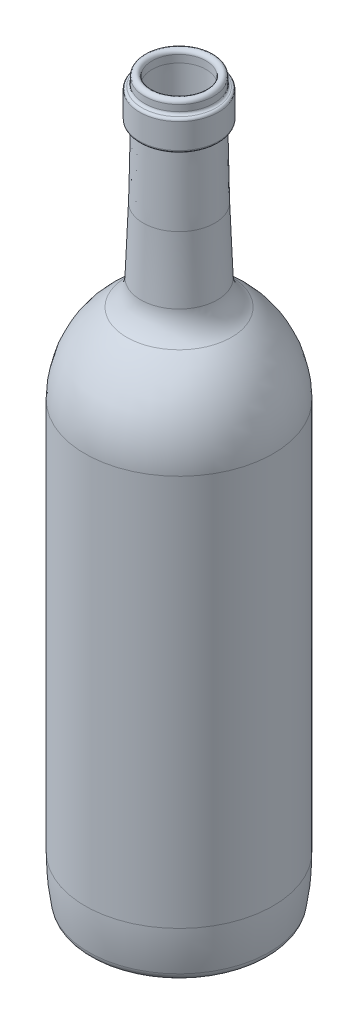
ISO-10303-21;
HEADER;
FILE_DESCRIPTION(('STEP AP214'),'2;1');
FILE_NAME('part.step','',(''),(''),'','','');
FILE_SCHEMA(('AUTOMOTIVE_DESIGN { 1 0 10303 214 1 1 1 1 }'));
ENDSEC;
DATA;
#1=APPLICATION_CONTEXT('core data for automotive mechanical design processes');
#2=APPLICATION_PROTOCOL_DEFINITION('international standard','automotive_design',2000,#1);
#3=PRODUCT_CONTEXT('',#1,'mechanical');
#4=PRODUCT('Part','Part','',(#3));
#5=PRODUCT_RELATED_PRODUCT_CATEGORY('part','',(#4));
#6=PRODUCT_DEFINITION_FORMATION('','',#4);
#7=PRODUCT_DEFINITION_CONTEXT('part definition',#1,'design');
#8=PRODUCT_DEFINITION('design','',#6,#7);
#9=PRODUCT_DEFINITION_SHAPE('','',#8);
#10=(LENGTH_UNIT() NAMED_UNIT(*) SI_UNIT(.MILLI.,.METRE.));
#11=(NAMED_UNIT(*) PLANE_ANGLE_UNIT() SI_UNIT($,.RADIAN.));
#12=(NAMED_UNIT(*) SI_UNIT($,.STERADIAN.) SOLID_ANGLE_UNIT());
#13=UNCERTAINTY_MEASURE_WITH_UNIT(LENGTH_MEASURE(1.E-05),#10,'distance_accuracy_value','');
#14=(GEOMETRIC_REPRESENTATION_CONTEXT(3) GLOBAL_UNCERTAINTY_ASSIGNED_CONTEXT((#13)) GLOBAL_UNIT_ASSIGNED_CONTEXT((#10,
#11,#12)) REPRESENTATION_CONTEXT('',''));
#15=CARTESIAN_POINT('',(0.,0.,0.));
#16=DIRECTION('',(0.,0.,1.));
#17=DIRECTION('',(1.,0.,0.));
#18=AXIS2_PLACEMENT_3D('',#15,#16,#17);
#19=CARTESIAN_POINT('',(0.,-22.,0.));
#20=DIRECTION('',(0.,-1.,0.));
#21=DIRECTION('',(-1.,0.,0.));
#22=AXIS2_PLACEMENT_3D('',#19,#20,#21);
#23=SPHERICAL_SURFACE('',#22,30.);
#24=CARTESIAN_POINT('',(0.,6.77725143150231,0.));
#25=DIRECTION('',(0.,-1.,0.));
#26=DIRECTION('',(0.,0.,-1.));
#27=AXIS2_PLACEMENT_3D('',#24,#25,#26);
#28=CIRCLE('',#27,8.47760579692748);
#29=CARTESIAN_POINT('',(0.,6.77725143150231,-8.47760579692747));
#30=VERTEX_POINT('',#29);
#31=EDGE_CURVE('E10',#30,#30,#28,.T.);
#32=ORIENTED_EDGE('',*,*,#31,.T.);
#33=EDGE_LOOP('',(#32));
#34=FACE_BOUND('',#33,.T.);
#35=ADVANCED_FACE('F32',(#34),#23,.F.);
#36=CARTESIAN_POINT('',(0.,0.163033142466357,0.));
#37=DIRECTION('',(0.,-1.,0.));
#38=DIRECTION('',(0.,0.,-1.));
#39=AXIS2_PLACEMENT_3D('',#36,#37,#38);
#40=CONICAL_SURFACE('',#39,30.9295842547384,1.28430650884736);
#41=CARTESIAN_POINT('',(0.,0.163033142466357,0.));
#42=DIRECTION('',(0.,-1.,0.));
#43=DIRECTION('',(0.,0.,-1.));
#44=AXIS2_PLACEMENT_3D('',#41,#42,#43);
#45=CIRCLE('',#44,30.9295842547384);
#46=CARTESIAN_POINT('',(0.,0.163033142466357,-30.9295842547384));
#47=VERTEX_POINT('',#46);
#48=EDGE_CURVE('E38',#47,#47,#45,.T.);
#49=CARTESIAN_POINT('',(0.,6.77725143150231,-8.47760579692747));
#50=CARTESIAN_POINT('',(0.,6.70835332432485,-8.71148057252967));
#51=CARTESIAN_POINT('',(0.,6.6394552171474,-8.94535534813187));
#52=CARTESIAN_POINT('',(0.,6.50165900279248,-9.41310489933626));
#53=CARTESIAN_POINT('',(0.,6.43276089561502,-9.64697967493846));
#54=CARTESIAN_POINT('',(0.,6.29496468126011,-10.1147292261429));
#55=CARTESIAN_POINT('',(0.,6.22606657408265,-10.348604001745));
#56=CARTESIAN_POINT('',(0.,6.08827035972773,-10.8163535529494));
#57=CARTESIAN_POINT('',(0.,6.01937225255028,-11.0502283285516));
#58=CARTESIAN_POINT('',(0.,5.88157603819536,-11.517977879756));
#59=CARTESIAN_POINT('',(0.,5.8126779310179,-11.7518526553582));
#60=CARTESIAN_POINT('',(0.,5.67488171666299,-12.2196022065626));
#61=CARTESIAN_POINT('',(0.,5.60598360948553,-12.4534769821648));
#62=CARTESIAN_POINT('',(0.,5.46818739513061,-12.9212265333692));
#63=CARTESIAN_POINT('',(0.,5.39928928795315,-13.1551013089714));
#64=CARTESIAN_POINT('',(0.,5.26149307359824,-13.6228508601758));
#65=CARTESIAN_POINT('',(0.,5.19259496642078,-13.856725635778));
#66=CARTESIAN_POINT('',(0.,5.05479875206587,-14.3244751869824));
#67=CARTESIAN_POINT('',(0.,4.98590064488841,-14.5583499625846));
#68=CARTESIAN_POINT('',(0.,4.84810443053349,-15.026099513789));
#69=CARTESIAN_POINT('',(0.,4.77920632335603,-15.2599742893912));
#70=CARTESIAN_POINT('',(0.,4.64141010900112,-15.7277238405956));
#71=CARTESIAN_POINT('',(0.,4.57251200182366,-15.9615986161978));
#72=CARTESIAN_POINT('',(0.,4.43471578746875,-16.4293481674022));
#73=CARTESIAN_POINT('',(0.,4.36581768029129,-16.6632229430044));
#74=CARTESIAN_POINT('',(0.,4.22802146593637,-17.1309724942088));
#75=CARTESIAN_POINT('',(0.,4.15912335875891,-17.364847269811));
#76=CARTESIAN_POINT('',(0.,4.021327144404,-17.8325968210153));
#77=CARTESIAN_POINT('',(0.,3.95242903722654,-18.0664715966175));
#78=CARTESIAN_POINT('',(0.,3.81463282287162,-18.5342211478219));
#79=CARTESIAN_POINT('',(0.,3.74573471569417,-18.7680959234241));
#80=CARTESIAN_POINT('',(0.,3.60793850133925,-19.2358454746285));
#81=CARTESIAN_POINT('',(0.,3.53904039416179,-19.4697202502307));
#82=CARTESIAN_POINT('',(0.,3.40124417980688,-19.9374698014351));
#83=CARTESIAN_POINT('',(0.,3.33234607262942,-20.1713445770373));
#84=CARTESIAN_POINT('',(0.,3.1945498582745,-20.6390941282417));
#85=CARTESIAN_POINT('',(0.,3.12565175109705,-20.8729689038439));
#86=CARTESIAN_POINT('',(0.,2.98785553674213,-21.3407184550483));
#87=CARTESIAN_POINT('',(0.,2.91895742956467,-21.5745932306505));
#88=CARTESIAN_POINT('',(0.,2.78116121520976,-22.0423427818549));
#89=CARTESIAN_POINT('',(0.,2.7122631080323,-22.2762175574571));
#90=CARTESIAN_POINT('',(0.,2.57446689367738,-22.7439671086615));
#91=CARTESIAN_POINT('',(0.,2.50556878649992,-22.9778418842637));
#92=CARTESIAN_POINT('',(0.,2.36777257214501,-23.4455914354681));
#93=CARTESIAN_POINT('',(0.,2.29887446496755,-23.6794662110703));
#94=CARTESIAN_POINT('',(0.,2.16107825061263,-24.1472157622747));
#95=CARTESIAN_POINT('',(0.,2.09218014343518,-24.3810905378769));
#96=CARTESIAN_POINT('',(0.,1.95438392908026,-24.8488400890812));
#97=CARTESIAN_POINT('',(0.,1.8854858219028,-25.0827148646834));
#98=CARTESIAN_POINT('',(0.,1.74768960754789,-25.5504644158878));
#99=CARTESIAN_POINT('',(0.,1.67879150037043,-25.78433919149));
#100=CARTESIAN_POINT('',(0.,1.54099528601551,-26.2520887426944));
#101=CARTESIAN_POINT('',(0.,1.47209717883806,-26.4859635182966));
#102=CARTESIAN_POINT('',(0.,1.33430096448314,-26.953713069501));
#103=CARTESIAN_POINT('',(0.,1.26540285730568,-27.1875878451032));
#104=CARTESIAN_POINT('',(0.,1.12760664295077,-27.6553373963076));
#105=CARTESIAN_POINT('',(0.,1.05870853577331,-27.8892121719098));
#106=CARTESIAN_POINT('',(0.,0.920912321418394,-28.3569617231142));
#107=CARTESIAN_POINT('',(0.,0.852014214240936,-28.5908364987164));
#108=CARTESIAN_POINT('',(0.,0.71421799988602,-29.0585860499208));
#109=CARTESIAN_POINT('',(0.,0.645319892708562,-29.292460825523));
#110=CARTESIAN_POINT('',(0.,0.507523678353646,-29.7602103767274));
#111=CARTESIAN_POINT('',(0.,0.438625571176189,-29.9940851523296));
#112=CARTESIAN_POINT('',(0.,0.300829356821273,-30.461834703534));
#113=CARTESIAN_POINT('',(0.,0.231931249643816,-30.6957094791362));
#114=CARTESIAN_POINT('',(0.,0.163033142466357,-30.9295842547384));
#115=B_SPLINE_CURVE_WITH_KNOTS('',3,(#49,#50,#51,#52,#53,#54,#55,#56,#57,#58,#59,#60,#61,#62,
#63,#64,#65,#66,#67,#68,#69,#70,#71,#72,#73,#74,#75,#76,#77,#78,#79,#80,#81,#82,#83,#84,#85,#86,
#87,#88,#89,#90,#91,#92,#93,#94,#95,#96,#97,#98,#99,#100,#101,#102,#103,#104,#105,#106,#107,
#108,#109,#110,#111,#112,#113,#114),.UNSPECIFIED.,.F.,.F.,(4,2,2,2,2,2,2,2,2,2,2,2,2,2,2,2,2,2,
2,2,2,2,2,2,2,2,2,2,2,2,2,2,4),(0.,0.731436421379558,1.46287284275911,2.19430926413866,
2.92574568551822,3.65718210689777,4.38861852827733,5.12005494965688,5.85149137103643,
6.58292779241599,7.31436421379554,8.0458006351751,8.77723705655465,9.50867347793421,
10.2401098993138,10.9715463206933,11.7029827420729,12.4344191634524,13.165855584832,
13.8972920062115,14.6287284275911,15.3601648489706,16.0916012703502,16.8230376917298,
17.5544741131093,18.2859105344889,19.0173469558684,19.748783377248,20.4802197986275,
21.2116562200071,21.9430926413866,22.6745290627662,23.4059654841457),.UNSPECIFIED.);
#116=EDGE_CURVE('BSEAM130',#30,#47,#115,.T.);
#117=ORIENTED_EDGE('',*,*,#31,.F.);
#118=ORIENTED_EDGE('',*,*,#48,.T.);
#119=ORIENTED_EDGE('',*,*,#116,.T.);
#120=ORIENTED_EDGE('',*,*,#116,.F.);
#121=EDGE_LOOP('',(#117,#119,#118,#120));
#122=FACE_BOUND('',#121,.T.);
#123=ADVANCED_FACE('F130',(#122),#40,.F.);
#124=CARTESIAN_POINT('',(0.,4.,0.));
#125=DIRECTION('',(0.,-1.,0.));
#126=DIRECTION('',(0.,0.,-1.));
#127=AXIS2_PLACEMENT_3D('',#124,#125,#126);
#128=TOROIDAL_SURFACE('',#127,32.0599316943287,4.);
#129=ORIENTED_EDGE('',*,*,#48,.F.);
#130=EDGE_LOOP('',(#129));
#131=FACE_BOUND('',#130,.T.);
#132=CARTESIAN_POINT('',(0.,3.31017266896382,0.));
#133=DIRECTION('',(0.,-1.,0.));
#134=DIRECTION('',(0.,0.,-1.));
#135=AXIS2_PLACEMENT_3D('',#132,#133,#134);
#136=CIRCLE('',#135,36.);
#137=CARTESIAN_POINT('',(0.,3.31017266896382,-36.));
#138=VERTEX_POINT('',#137);
#139=EDGE_CURVE('E42',#138,#138,#136,.T.);
#140=ORIENTED_EDGE('',*,*,#139,.T.);
#141=EDGE_LOOP('',(#140));
#142=FACE_BOUND('',#141,.T.);
#143=ADVANCED_FACE('F134',(#131,#142),#128,.T.);
#144=CARTESIAN_POINT('',(0.,20.,0.));
#145=DIRECTION('',(0.,-1.,0.));
#146=DIRECTION('',(0.,0.,-1.));
#147=AXIS2_PLACEMENT_3D('',#144,#145,#146);
#148=DEGENERATE_TOROIDAL_SURFACE('',#147,59.3268401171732,96.7768401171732,.F.);
#149=ORIENTED_EDGE('',*,*,#139,.F.);
#150=EDGE_LOOP('',(#149));
#151=FACE_BOUND('',#150,.T.);
#152=CARTESIAN_POINT('',(0.,20.,0.));
#153=DIRECTION('',(0.,-1.,0.));
#154=DIRECTION('',(0.,0.,-1.));
#155=AXIS2_PLACEMENT_3D('',#152,#153,#154);
#156=CIRCLE('',#155,37.45);
#157=CARTESIAN_POINT('',(0.,20.,-37.45));
#158=VERTEX_POINT('',#157);
#159=EDGE_CURVE('E46',#158,#158,#156,.T.);
#160=ORIENTED_EDGE('',*,*,#159,.T.);
#161=EDGE_LOOP('',(#160));
#162=FACE_BOUND('',#161,.T.);
#163=ADVANCED_FACE('F139',(#151,#162),#148,.F.);
#164=CARTESIAN_POINT('',(0.,0.,0.));
#165=DIRECTION('',(0.,-1.,0.));
#166=DIRECTION('',(0.,0.,-1.));
#167=AXIS2_PLACEMENT_3D('',#164,#165,#166);
#168=CYLINDRICAL_SURFACE('',#167,37.45);
#169=ORIENTED_EDGE('',*,*,#159,.F.);
#170=EDGE_LOOP('',(#169));
#171=FACE_BOUND('',#170,.T.);
#172=CARTESIAN_POINT('',(0.,176.,0.));
#173=DIRECTION('',(0.,-1.,0.));
#174=DIRECTION('',(0.,0.,-1.));
#175=AXIS2_PLACEMENT_3D('',#172,#173,#174);
#176=CIRCLE('',#175,37.45);
#177=CARTESIAN_POINT('',(0.,176.,-37.45));
#178=VERTEX_POINT('',#177);
#179=EDGE_CURVE('E51',#178,#178,#176,.T.);
#180=ORIENTED_EDGE('',*,*,#179,.T.);
#181=EDGE_LOOP('',(#180));
#182=FACE_BOUND('',#181,.T.);
#183=ADVANCED_FACE('F145',(#171,#182),#168,.T.);
#184=CARTESIAN_POINT('',(0.,176.,0.));
#185=DIRECTION('',(0.,-1.,0.));
#186=DIRECTION('',(0.,0.,-1.));
#187=AXIS2_PLACEMENT_3D('',#184,#185,#186);
#188=DEGENERATE_TOROIDAL_SURFACE('',#187,1.55,39.,.F.);
#189=ORIENTED_EDGE('',*,*,#179,.F.);
#190=EDGE_LOOP('',(#189));
#191=FACE_BOUND('',#190,.T.);
#192=CARTESIAN_POINT('',(0.,207.910311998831,0.));
#193=DIRECTION('',(0.,-1.,0.));
#194=DIRECTION('',(0.,0.,-1.));
#195=AXIS2_PLACEMENT_3D('',#192,#193,#194);
#196=CIRCLE('',#195,20.8716856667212);
#197=CARTESIAN_POINT('',(0.,207.910311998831,-20.8716856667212));
#198=VERTEX_POINT('',#197);
#199=EDGE_CURVE('E54',#198,#198,#196,.T.);
#200=ORIENTED_EDGE('',*,*,#199,.T.);
#201=EDGE_LOOP('',(#200));
#202=FACE_BOUND('',#201,.T.);
#203=ADVANCED_FACE('F149',(#191,#202),#188,.F.);
#204=CARTESIAN_POINT('',(0.,218.774583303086,0.));
#205=DIRECTION('',(0.,-1.,0.));
#206=DIRECTION('',(0.,0.,-1.));
#207=AXIS2_PLACEMENT_3D('',#204,#205,#206);
#208=TOROIDAL_SURFACE('',#207,28.5054335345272,13.2780456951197);
#209=ORIENTED_EDGE('',*,*,#199,.F.);
#210=EDGE_LOOP('',(#209));
#211=FACE_BOUND('',#210,.T.);
#212=CARTESIAN_POINT('',(0.,218.,0.));
#213=DIRECTION('',(0.,-1.,0.));
#214=DIRECTION('',(0.,0.,-1.));
#215=AXIS2_PLACEMENT_3D('',#212,#213,#214);
#216=CIRCLE('',#215,15.25);
#217=CARTESIAN_POINT('',(0.,218.,-15.25));
#218=VERTEX_POINT('',#217);
#219=EDGE_CURVE('E57',#218,#218,#216,.T.);
#220=ORIENTED_EDGE('',*,*,#219,.T.);
#221=EDGE_LOOP('',(#220));
#222=FACE_BOUND('',#221,.T.);
#223=ADVANCED_FACE('F153',(#211,#222),#208,.F.);
#224=CARTESIAN_POINT('',(0.,256.089285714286,0.));
#225=DIRECTION('',(0.,-1.,0.));
#226=DIRECTION('',(0.,0.,-1.));
#227=AXIS2_PLACEMENT_3D('',#224,#225,#226);
#228=TOROIDAL_SURFACE('',#227,667.07142857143,652.933356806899);
#229=ORIENTED_EDGE('',*,*,#219,.F.);
#230=EDGE_LOOP('',(#229));
#231=FACE_BOUND('',#230,.T.);
#232=CARTESIAN_POINT('',(0.,244.,0.));
#233=DIRECTION('',(0.,-1.,0.));
#234=DIRECTION('',(0.,0.,-1.));
#235=AXIS2_PLACEMENT_3D('',#232,#233,#234);
#236=CIRCLE('',#235,14.25);
#237=CARTESIAN_POINT('',(0.,244.,-14.25));
#238=VERTEX_POINT('',#237);
#239=EDGE_CURVE('E60',#238,#238,#236,.T.);
#240=ORIENTED_EDGE('',*,*,#239,.T.);
#241=EDGE_LOOP('',(#240));
#242=FACE_BOUND('',#241,.T.);
#243=ADVANCED_FACE('F157',(#231,#242),#228,.F.);
#244=CARTESIAN_POINT('',(0.,271.,0.));
#245=DIRECTION('',(0.,-1.,0.));
#246=DIRECTION('',(0.,0.,-1.));
#247=AXIS2_PLACEMENT_3D('',#244,#245,#246);
#248=CONICAL_SURFACE('',#247,13.75,0.0185164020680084);
#249=ORIENTED_EDGE('',*,*,#239,.F.);
#250=EDGE_LOOP('',(#249));
#251=FACE_BOUND('',#250,.T.);
#252=CARTESIAN_POINT('',(0.,271.,0.));
#253=DIRECTION('',(0.,-1.,0.));
#254=DIRECTION('',(0.,0.,-1.));
#255=AXIS2_PLACEMENT_3D('',#252,#253,#254);
#256=CIRCLE('',#255,13.75);
#257=CARTESIAN_POINT('',(0.,271.,-13.75));
#258=VERTEX_POINT('',#257);
#259=EDGE_CURVE('E63',#258,#258,#256,.T.);
#260=ORIENTED_EDGE('',*,*,#259,.T.);
#261=EDGE_LOOP('',(#260));
#262=FACE_BOUND('',#261,.T.);
#263=ADVANCED_FACE('F161',(#251,#262),#248,.T.);
#264=CARTESIAN_POINT('',(0.,271.018515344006,0.));
#265=DIRECTION('',(0.,-1.,0.));
#266=DIRECTION('',(0.,0.,-1.));
#267=AXIS2_PLACEMENT_3D('',#264,#265,#266);
#268=TOROIDAL_SURFACE('',#267,14.7498285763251,1.00000000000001);
#269=ORIENTED_EDGE('',*,*,#259,.F.);
#270=EDGE_LOOP('',(#269));
#271=FACE_BOUND('',#270,.T.);
#272=CARTESIAN_POINT('',(0.,272.018515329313,0.));
#273=DIRECTION('',(0.,-1.,0.));
#274=DIRECTION('',(0.,0.,-1.));
#275=AXIS2_PLACEMENT_3D('',#272,#273,#274);
#276=CIRCLE('',#275,14.75);
#277=CARTESIAN_POINT('',(0.,272.018515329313,-14.75));
#278=VERTEX_POINT('',#277);
#279=EDGE_CURVE('E66',#278,#278,#276,.T.);
#280=ORIENTED_EDGE('',*,*,#279,.T.);
#281=EDGE_LOOP('',(#280));
#282=FACE_BOUND('',#281,.T.);
#283=ADVANCED_FACE('F165',(#271,#282),#268,.F.);
#284=CARTESIAN_POINT('',(0.,273.018343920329,0.));
#285=DIRECTION('',(0.,-1.,0.));
#286=DIRECTION('',(0.,0.,-1.));
#287=AXIS2_PLACEMENT_3D('',#284,#285,#286);
#288=TOROIDAL_SURFACE('',#287,14.7501713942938,0.999828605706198);
#289=ORIENTED_EDGE('',*,*,#279,.F.);
#290=EDGE_LOOP('',(#289));
#291=FACE_BOUND('',#290,.T.);
#292=CARTESIAN_POINT('',(0.,273.018343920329,0.));
#293=DIRECTION('',(0.,-1.,0.));
#294=DIRECTION('',(0.,0.,-1.));
#295=AXIS2_PLACEMENT_3D('',#292,#293,#294);
#296=CIRCLE('',#295,15.75);
#297=CARTESIAN_POINT('',(0.,273.018343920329,-15.75));
#298=VERTEX_POINT('',#297);
#299=EDGE_CURVE('E69',#298,#298,#296,.T.);
#300=ORIENTED_EDGE('',*,*,#299,.T.);
#301=EDGE_LOOP('',(#300));
#302=FACE_BOUND('',#301,.T.);
#303=ADVANCED_FACE('F169',(#291,#302),#288,.T.);
#304=CARTESIAN_POINT('',(0.,0.,0.));
#305=DIRECTION('',(0.,-1.,0.));
#306=DIRECTION('',(0.,0.,-1.));
#307=AXIS2_PLACEMENT_3D('',#304,#305,#306);
#308=CYLINDRICAL_SURFACE('',#307,15.75);
#309=ORIENTED_EDGE('',*,*,#299,.F.);
#310=EDGE_LOOP('',(#309));
#311=FACE_BOUND('',#310,.T.);
#312=CARTESIAN_POINT('',(0.,283.018343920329,0.));
#313=DIRECTION('',(0.,-1.,0.));
#314=DIRECTION('',(0.,0.,-1.));
#315=AXIS2_PLACEMENT_3D('',#312,#313,#314);
#316=CIRCLE('',#315,15.75);
#317=CARTESIAN_POINT('',(0.,283.018343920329,-15.75));
#318=VERTEX_POINT('',#317);
#319=EDGE_CURVE('E72',#318,#318,#316,.T.);
#320=ORIENTED_EDGE('',*,*,#319,.T.);
#321=EDGE_LOOP('',(#320));
#322=FACE_BOUND('',#321,.T.);
#323=ADVANCED_FACE('F173',(#311,#322),#308,.T.);
#324=CARTESIAN_POINT('',(0.,283.018343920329,0.));
#325=DIRECTION('',(0.,-1.,0.));
#326=DIRECTION('',(0.,0.,-1.));
#327=AXIS2_PLACEMENT_3D('',#324,#325,#326);
#328=TOROIDAL_SURFACE('',#327,14.75,1.);
#329=ORIENTED_EDGE('',*,*,#319,.F.);
#330=EDGE_LOOP('',(#329));
#331=FACE_BOUND('',#330,.T.);
#332=CARTESIAN_POINT('',(0.,284.018343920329,0.));
#333=DIRECTION('',(0.,-1.,0.));
#334=DIRECTION('',(0.,0.,-1.));
#335=AXIS2_PLACEMENT_3D('',#332,#333,#334);
#336=CIRCLE('',#335,14.75);
#337=CARTESIAN_POINT('',(0.,284.018343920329,-14.75));
#338=VERTEX_POINT('',#337);
#339=EDGE_CURVE('E75',#338,#338,#336,.T.);
#340=ORIENTED_EDGE('',*,*,#339,.T.);
#341=EDGE_LOOP('',(#340));
#342=FACE_BOUND('',#341,.T.);
#343=ADVANCED_FACE('F177',(#331,#342),#328,.T.);
#344=CARTESIAN_POINT('',(0.,285.018343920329,0.));
#345=DIRECTION('',(0.,-1.,0.));
#346=DIRECTION('',(0.,0.,-1.));
#347=AXIS2_PLACEMENT_3D('',#344,#345,#346);
#348=TOROIDAL_SURFACE('',#347,14.75,1.);
#349=ORIENTED_EDGE('',*,*,#339,.F.);
#350=EDGE_LOOP('',(#349));
#351=FACE_BOUND('',#350,.T.);
#352=CARTESIAN_POINT('',(0.,285.018343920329,0.));
#353=DIRECTION('',(0.,-1.,0.));
#354=DIRECTION('',(0.,0.,-1.));
#355=AXIS2_PLACEMENT_3D('',#352,#353,#354);
#356=CIRCLE('',#355,13.75);
#357=CARTESIAN_POINT('',(0.,285.018343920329,-13.75));
#358=VERTEX_POINT('',#357);
#359=EDGE_CURVE('E78',#358,#358,#356,.T.);
#360=ORIENTED_EDGE('',*,*,#359,.T.);
#361=EDGE_LOOP('',(#360));
#362=FACE_BOUND('',#361,.T.);
#363=ADVANCED_FACE('F181',(#351,#362),#348,.F.);
#364=CARTESIAN_POINT('',(0.,0.,0.));
#365=DIRECTION('',(0.,-1.,0.));
#366=DIRECTION('',(0.,0.,-1.));
#367=AXIS2_PLACEMENT_3D('',#364,#365,#366);
#368=CYLINDRICAL_SURFACE('',#367,13.75);
#369=ORIENTED_EDGE('',*,*,#359,.F.);
#370=EDGE_LOOP('',(#369));
#371=FACE_BOUND('',#370,.T.);
#372=CARTESIAN_POINT('',(0.,287.5,0.));
#373=DIRECTION('',(0.,-1.,0.));
#374=DIRECTION('',(0.,0.,-1.));
#375=AXIS2_PLACEMENT_3D('',#372,#373,#374);
#376=CIRCLE('',#375,13.75);
#377=CARTESIAN_POINT('',(0.,287.5,-13.75));
#378=VERTEX_POINT('',#377);
#379=EDGE_CURVE('E81',#378,#378,#376,.T.);
#380=ORIENTED_EDGE('',*,*,#379,.T.);
#381=EDGE_LOOP('',(#380));
#382=FACE_BOUND('',#381,.T.);
#383=ADVANCED_FACE('F185',(#371,#382),#368,.T.);
#384=CARTESIAN_POINT('',(0.,287.5,0.));
#385=DIRECTION('',(0.,-1.,0.));
#386=DIRECTION('',(0.,0.,-1.));
#387=AXIS2_PLACEMENT_3D('',#384,#385,#386);
#388=TOROIDAL_SURFACE('',#387,12.25,1.5);
#389=ORIENTED_EDGE('',*,*,#379,.F.);
#390=EDGE_LOOP('',(#389));
#391=FACE_BOUND('',#390,.T.);
#392=CARTESIAN_POINT('',(0.,287.5,0.));
#393=DIRECTION('',(0.,-1.,0.));
#394=DIRECTION('',(0.,0.,-1.));
#395=AXIS2_PLACEMENT_3D('',#392,#393,#394);
#396=CIRCLE('',#395,10.75);
#397=CARTESIAN_POINT('',(0.,287.5,-10.75));
#398=VERTEX_POINT('',#397);
#399=EDGE_CURVE('E84',#398,#398,#396,.T.);
#400=ORIENTED_EDGE('',*,*,#399,.T.);
#401=EDGE_LOOP('',(#400));
#402=FACE_BOUND('',#401,.T.);
#403=ADVANCED_FACE('F189',(#391,#402),#388,.T.);
#404=CARTESIAN_POINT('',(0.,284.500189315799,0.));
#405=DIRECTION('',(0.,-1.,0.));
#406=DIRECTION('',(0.,0.,-1.));
#407=AXIS2_PLACEMENT_3D('',#404,#405,#406);
#408=CONICAL_SURFACE('',#407,10.7837025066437,0.0112344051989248);
#409=ORIENTED_EDGE('',*,*,#399,.F.);
#410=EDGE_LOOP('',(#409));
#411=FACE_BOUND('',#410,.T.);
#412=CARTESIAN_POINT('',(0.,284.500189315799,0.));
#413=DIRECTION('',(0.,-1.,0.));
#414=DIRECTION('',(0.,0.,-1.));
#415=AXIS2_PLACEMENT_3D('',#412,#413,#414);
#416=CIRCLE('',#415,10.7837025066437);
#417=CARTESIAN_POINT('',(0.,284.500189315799,-10.7837025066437));
#418=VERTEX_POINT('',#417);
#419=EDGE_CURVE('E87',#418,#418,#416,.T.);
#420=ORIENTED_EDGE('',*,*,#419,.T.);
#421=EDGE_LOOP('',(#420));
#422=FACE_BOUND('',#421,.T.);
#423=ADVANCED_FACE('F193',(#411,#422),#408,.F.);
#424=CARTESIAN_POINT('',(0.,270.944453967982,0.));
#425=DIRECTION('',(0.,1.,0.));
#426=DIRECTION('',(0.,0.,1.));
#427=AXIS2_PLACEMENT_3D('',#424,#425,#426);
#428=CONICAL_SURFACE('',#427,10.7505142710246,0.00244827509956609);
#429=ORIENTED_EDGE('',*,*,#419,.F.);
#430=EDGE_LOOP('',(#429));
#431=FACE_BOUND('',#430,.T.);
#432=CARTESIAN_POINT('',(0.,270.944453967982,0.));
#433=DIRECTION('',(0.,-1.,0.));
#434=DIRECTION('',(0.,0.,-1.));
#435=AXIS2_PLACEMENT_3D('',#432,#433,#434);
#436=CIRCLE('',#435,10.7505142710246);
#437=CARTESIAN_POINT('',(0.,270.944453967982,-10.7505142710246));
#438=VERTEX_POINT('',#437);
#439=EDGE_CURVE('E90',#438,#438,#436,.T.);
#440=ORIENTED_EDGE('',*,*,#439,.T.);
#441=EDGE_LOOP('',(#440));
#442=FACE_BOUND('',#441,.T.);
#443=ADVANCED_FACE('F197',(#431,#442),#428,.F.);
#444=CARTESIAN_POINT('',(0.,243.944453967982,0.));
#445=DIRECTION('',(0.,-1.,0.));
#446=DIRECTION('',(0.,0.,-1.));
#447=AXIS2_PLACEMENT_3D('',#444,#445,#446);
#448=CONICAL_SURFACE('',#447,11.2505142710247,0.0185164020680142);
#449=ORIENTED_EDGE('',*,*,#439,.F.);
#450=EDGE_LOOP('',(#449));
#451=FACE_BOUND('',#450,.T.);
#452=CARTESIAN_POINT('',(0.,243.944453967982,0.));
#453=DIRECTION('',(0.,-1.,0.));
#454=DIRECTION('',(0.,0.,-1.));
#455=AXIS2_PLACEMENT_3D('',#452,#453,#454);
#456=CIRCLE('',#455,11.2505142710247);
#457=CARTESIAN_POINT('',(0.,243.944453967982,-11.2505142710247));
#458=VERTEX_POINT('',#457);
#459=EDGE_CURVE('E93',#458,#458,#456,.T.);
#460=ORIENTED_EDGE('',*,*,#459,.T.);
#461=EDGE_LOOP('',(#460));
#462=FACE_BOUND('',#461,.T.);
#463=ADVANCED_FACE('F201',(#451,#462),#448,.F.);
#464=CARTESIAN_POINT('',(0.,256.089285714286,0.));
#465=DIRECTION('',(0.,-1.,0.));
#466=DIRECTION('',(0.,0.,-1.));
#467=AXIS2_PLACEMENT_3D('',#464,#465,#466);
#468=TOROIDAL_SURFACE('',#467,667.07142857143,655.933356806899);
#469=ORIENTED_EDGE('',*,*,#459,.F.);
#470=EDGE_LOOP('',(#469));
#471=FACE_BOUND('',#470,.T.);
#472=CARTESIAN_POINT('',(0.,217.824993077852,0.));
#473=DIRECTION('',(0.,-1.,0.));
#474=DIRECTION('',(0.,0.,-1.));
#475=AXIS2_PLACEMENT_3D('',#472,#473,#474);
#476=CIRCLE('',#475,12.2551089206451);
#477=CARTESIAN_POINT('',(0.,217.824993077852,-12.2551089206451));
#478=VERTEX_POINT('',#477);
#479=EDGE_CURVE('E96',#478,#478,#476,.T.);
#480=ORIENTED_EDGE('',*,*,#479,.T.);
#481=EDGE_LOOP('',(#480));
#482=FACE_BOUND('',#481,.T.);
#483=ADVANCED_FACE('F205',(#471,#482),#468,.T.);
#484=CARTESIAN_POINT('',(0.,218.774583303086,0.));
#485=DIRECTION('',(0.,-1.,0.));
#486=DIRECTION('',(0.,0.,-1.));
#487=AXIS2_PLACEMENT_3D('',#484,#485,#486);
#488=TOROIDAL_SURFACE('',#487,28.5054335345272,16.2780456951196);
#489=ORIENTED_EDGE('',*,*,#479,.F.);
#490=EDGE_LOOP('',(#489));
#491=FACE_BOUND('',#490,.T.);
#492=CARTESIAN_POINT('',(0.,205.455672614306,0.));
#493=DIRECTION('',(0.,-1.,0.));
#494=DIRECTION('',(0.,0.,-1.));
#495=AXIS2_PLACEMENT_3D('',#492,#493,#494);
#496=CIRCLE('',#495,19.146940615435);
#497=CARTESIAN_POINT('',(0.,205.455672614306,-19.146940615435));
#498=VERTEX_POINT('',#497);
#499=EDGE_CURVE('E99',#498,#498,#496,.T.);
#500=ORIENTED_EDGE('',*,*,#499,.T.);
#501=EDGE_LOOP('',(#500));
#502=FACE_BOUND('',#501,.T.);
#503=ADVANCED_FACE('F209',(#491,#502),#488,.T.);
#504=CARTESIAN_POINT('',(0.,176.,0.));
#505=DIRECTION('',(0.,-1.,0.));
#506=DIRECTION('',(0.,0.,-1.));
#507=AXIS2_PLACEMENT_3D('',#504,#505,#506);
#508=DEGENERATE_TOROIDAL_SURFACE('',#507,1.55,36.,.F.);
#509=ORIENTED_EDGE('',*,*,#499,.F.);
#510=EDGE_LOOP('',(#509));
#511=FACE_BOUND('',#510,.T.);
#512=CARTESIAN_POINT('',(0.,176.,0.));
#513=DIRECTION('',(0.,-1.,0.));
#514=DIRECTION('',(0.,0.,-1.));
#515=AXIS2_PLACEMENT_3D('',#512,#513,#514);
#516=CIRCLE('',#515,34.45);
#517=CARTESIAN_POINT('',(0.,176.,-34.45));
#518=VERTEX_POINT('',#517);
#519=EDGE_CURVE('E102',#518,#518,#516,.T.);
#520=ORIENTED_EDGE('',*,*,#519,.T.);
#521=EDGE_LOOP('',(#520));
#522=FACE_BOUND('',#521,.T.);
#523=ADVANCED_FACE('F213',(#511,#522),#508,.T.);
#524=CARTESIAN_POINT('',(0.,0.,0.));
#525=DIRECTION('',(0.,-1.,0.));
#526=DIRECTION('',(0.,0.,-1.));
#527=AXIS2_PLACEMENT_3D('',#524,#525,#526);
#528=CYLINDRICAL_SURFACE('',#527,34.45);
#529=ORIENTED_EDGE('',*,*,#519,.F.);
#530=EDGE_LOOP('',(#529));
#531=FACE_BOUND('',#530,.T.);
#532=CARTESIAN_POINT('',(0.,20.,0.));
#533=DIRECTION('',(0.,-1.,0.));
#534=DIRECTION('',(0.,0.,-1.));
#535=AXIS2_PLACEMENT_3D('',#532,#533,#534);
#536=CIRCLE('',#535,34.45);
#537=CARTESIAN_POINT('',(0.,20.,-34.45));
#538=VERTEX_POINT('',#537);
#539=EDGE_CURVE('E105',#538,#538,#536,.T.);
#540=ORIENTED_EDGE('',*,*,#539,.T.);
#541=EDGE_LOOP('',(#540));
#542=FACE_BOUND('',#541,.T.);
#543=ADVANCED_FACE('F217',(#531,#542),#528,.F.);
#544=CARTESIAN_POINT('',(0.,20.,0.));
#545=DIRECTION('',(0.,-1.,0.));
#546=DIRECTION('',(0.,0.,-1.));
#547=AXIS2_PLACEMENT_3D('',#544,#545,#546);
#548=DEGENERATE_TOROIDAL_SURFACE('',#547,59.3268401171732,93.7768401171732,.F.);
#549=ORIENTED_EDGE('',*,*,#539,.F.);
#550=EDGE_LOOP('',(#549));
#551=FACE_BOUND('',#550,.T.);
#552=CARTESIAN_POINT('',(0.,3.82754316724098,0.));
#553=DIRECTION('',(0.,-1.,0.));
#554=DIRECTION('',(0.,0.,-1.));
#555=AXIS2_PLACEMENT_3D('',#552,#553,#554);
#556=CIRCLE('',#555,33.0449487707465);
#557=CARTESIAN_POINT('',(0.,3.82754316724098,-33.0449487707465));
#558=VERTEX_POINT('',#557);
#559=EDGE_CURVE('E108',#558,#558,#556,.T.);
#560=ORIENTED_EDGE('',*,*,#559,.T.);
#561=EDGE_LOOP('',(#560));
#562=FACE_BOUND('',#561,.T.);
#563=ADVANCED_FACE('F221',(#551,#562),#548,.T.);
#564=CARTESIAN_POINT('',(0.,4.,0.));
#565=DIRECTION('',(0.,-1.,0.));
#566=DIRECTION('',(0.,0.,-1.));
#567=AXIS2_PLACEMENT_3D('',#564,#565,#566);
#568=TOROIDAL_SURFACE('',#567,32.0599316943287,1.);
#569=ORIENTED_EDGE('',*,*,#559,.F.);
#570=EDGE_LOOP('',(#569));
#571=FACE_BOUND('',#570,.T.);
#572=CARTESIAN_POINT('',(0.,3.04075828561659,0.));
#573=DIRECTION('',(0.,-1.,0.));
#574=DIRECTION('',(0.,0.,-1.));
#575=AXIS2_PLACEMENT_3D('',#572,#573,#574);
#576=CIRCLE('',#575,31.7773448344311);
#577=CARTESIAN_POINT('',(0.,3.04075828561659,-31.7773448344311));
#578=VERTEX_POINT('',#577);
#579=EDGE_CURVE('E111',#578,#578,#576,.T.);
#580=ORIENTED_EDGE('',*,*,#579,.T.);
#581=EDGE_LOOP('',(#580));
#582=FACE_BOUND('',#581,.T.);
#583=ADVANCED_FACE('F126',(#571,#582),#568,.F.);
#584=CARTESIAN_POINT('',(0.,9.65497657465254,0.));
#585=DIRECTION('',(0.,-1.,0.));
#586=DIRECTION('',(0.,0.,-1.));
#587=AXIS2_PLACEMENT_3D('',#584,#585,#586);
#588=CONICAL_SURFACE('',#587,9.32536637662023,1.28430650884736);
#589=CARTESIAN_POINT('',(0.,9.65497657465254,0.));
#590=DIRECTION('',(0.,-1.,0.));
#591=DIRECTION('',(0.,0.,-1.));
#592=AXIS2_PLACEMENT_3D('',#589,#590,#591);
#593=CIRCLE('',#592,9.32536637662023);
#594=CARTESIAN_POINT('',(0.,9.65497657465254,-9.32536637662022));
#595=VERTEX_POINT('',#594);
#596=EDGE_CURVE('E114',#595,#595,#593,.T.);
#597=CARTESIAN_POINT('',(0.,3.04075828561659,-31.7773448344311));
#598=CARTESIAN_POINT('',(0.,3.10965639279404,-31.5434700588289));
#599=CARTESIAN_POINT('',(0.,3.1785544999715,-31.3095952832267));
#600=CARTESIAN_POINT('',(0.,3.31635071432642,-30.8418457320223));
#601=CARTESIAN_POINT('',(0.,3.38524882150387,-30.6079709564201));
#602=CARTESIAN_POINT('',(0.,3.52304503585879,-30.1402214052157));
#603=CARTESIAN_POINT('',(0.,3.59194314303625,-29.9063466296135));
#604=CARTESIAN_POINT('',(0.,3.72973935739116,-29.4385970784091));
#605=CARTESIAN_POINT('',(0.,3.79863746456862,-29.204722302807));
#606=CARTESIAN_POINT('',(0.,3.93643367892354,-28.7369727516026));
#607=CARTESIAN_POINT('',(0.,4.00533178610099,-28.5030979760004));
#608=CARTESIAN_POINT('',(0.,4.14312800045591,-28.035348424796));
#609=CARTESIAN_POINT('',(0.,4.21202610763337,-27.8014736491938));
#610=CARTESIAN_POINT('',(0.,4.34982232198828,-27.3337240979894));
#611=CARTESIAN_POINT('',(0.,4.41872042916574,-27.0998493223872));
#612=CARTESIAN_POINT('',(0.,4.55651664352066,-26.6320997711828));
#613=CARTESIAN_POINT('',(0.,4.62541475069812,-26.3982249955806));
#614=CARTESIAN_POINT('',(0.,4.76321096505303,-25.9304754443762));
#615=CARTESIAN_POINT('',(0.,4.83210907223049,-25.696600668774));
#616=CARTESIAN_POINT('',(0.,4.9699052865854,-25.2288511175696));
#617=CARTESIAN_POINT('',(0.,5.03880339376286,-24.9949763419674));
#618=CARTESIAN_POINT('',(0.,5.17659960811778,-24.527226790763));
#619=CARTESIAN_POINT('',(0.,5.24549771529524,-24.2933520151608));
#620=CARTESIAN_POINT('',(0.,5.38329392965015,-23.8256024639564));
#621=CARTESIAN_POINT('',(0.,5.45219203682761,-23.5917276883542));
#622=CARTESIAN_POINT('',(0.,5.58998825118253,-23.1239781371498));
#623=CARTESIAN_POINT('',(0.,5.65888635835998,-22.8901033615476));
#624=CARTESIAN_POINT('',(0.,5.7966825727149,-22.4223538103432));
#625=CARTESIAN_POINT('',(0.,5.86558067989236,-22.1884790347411));
#626=CARTESIAN_POINT('',(0.,6.00337689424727,-21.7207294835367));
#627=CARTESIAN_POINT('',(0.,6.07227500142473,-21.4868547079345));
#628=CARTESIAN_POINT('',(0.,6.21007121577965,-21.0191051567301));
#629=CARTESIAN_POINT('',(0.,6.2789693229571,-20.7852303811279));
#630=CARTESIAN_POINT('',(0.,6.41676553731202,-20.3174808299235));
#631=CARTESIAN_POINT('',(0.,6.48566364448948,-20.0836060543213));
#632=CARTESIAN_POINT('',(0.,6.62345985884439,-19.6158565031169));
#633=CARTESIAN_POINT('',(0.,6.69235796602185,-19.3819817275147));
#634=CARTESIAN_POINT('',(0.,6.83015418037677,-18.9142321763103));
#635=CARTESIAN_POINT('',(0.,6.89905228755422,-18.6803574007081));
#636=CARTESIAN_POINT('',(0.,7.03684850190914,-18.2126078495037));
#637=CARTESIAN_POINT('',(0.,7.1057466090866,-17.9787330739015));
#638=CARTESIAN_POINT('',(0.,7.24354282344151,-17.5109835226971));
#639=CARTESIAN_POINT('',(0.,7.31244093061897,-17.2771087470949));
#640=CARTESIAN_POINT('',(0.,7.45023714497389,-16.8093591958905));
#641=CARTESIAN_POINT('',(0.,7.51913525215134,-16.5754844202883));
#642=CARTESIAN_POINT('',(0.,7.65693146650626,-16.1077348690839));
#643=CARTESIAN_POINT('',(0.,7.72582957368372,-15.8738600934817));
#644=CARTESIAN_POINT('',(0.,7.86362578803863,-15.4061105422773));
#645=CARTESIAN_POINT('',(0.,7.93252389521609,-15.1722357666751));
#646=CARTESIAN_POINT('',(0.,8.07032010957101,-14.7044862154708));
#647=CARTESIAN_POINT('',(0.,8.13921821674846,-14.4706114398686));
#648=CARTESIAN_POINT('',(0.,8.27701443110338,-14.0028618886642));
#649=CARTESIAN_POINT('',(0.,8.34591253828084,-13.768987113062));
#650=CARTESIAN_POINT('',(0.,8.48370875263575,-13.3012375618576));
#651=CARTESIAN_POINT('',(0.,8.55260685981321,-13.0673627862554));
#652=CARTESIAN_POINT('',(0.,8.69040307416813,-12.599613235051));
#653=CARTESIAN_POINT('',(0.,8.75930118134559,-12.3657384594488));
#654=CARTESIAN_POINT('',(0.,8.8970973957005,-11.8979889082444));
#655=CARTESIAN_POINT('',(0.,8.96599550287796,-11.6641141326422));
#656=CARTESIAN_POINT('',(0.,9.10379171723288,-11.1963645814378));
#657=CARTESIAN_POINT('',(0.,9.17268982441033,-10.9624898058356));
#658=CARTESIAN_POINT('',(0.,9.31048603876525,-10.4947402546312));
#659=CARTESIAN_POINT('',(0.,9.37938414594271,-10.260865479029));
#660=CARTESIAN_POINT('',(0.,9.51718036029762,-9.79311592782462));
#661=CARTESIAN_POINT('',(0.,9.58607846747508,-9.55924115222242));
#662=CARTESIAN_POINT('',(0.,9.65497657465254,-9.32536637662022));
#663=B_SPLINE_CURVE_WITH_KNOTS('',3,(#597,#598,#599,#600,#601,#602,#603,#604,#605,#606,#607,
#608,#609,#610,#611,#612,#613,#614,#615,#616,#617,#618,#619,#620,#621,#622,#623,#624,#625,#626,
#627,#628,#629,#630,#631,#632,#633,#634,#635,#636,#637,#638,#639,#640,#641,#642,#643,#644,#645,
#646,#647,#648,#649,#650,#651,#652,#653,#654,#655,#656,#657,#658,#659,#660,#661,#662),
.UNSPECIFIED.,.F.,.F.,(4,2,2,2,2,2,2,2,2,2,2,2,2,2,2,2,2,2,2,2,2,2,2,2,2,2,2,2,2,2,2,2,4),(0.,
0.731436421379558,1.46287284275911,2.19430926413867,2.92574568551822,3.65718210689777,
4.38861852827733,5.12005494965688,5.85149137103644,6.58292779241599,7.31436421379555,
8.0458006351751,8.77723705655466,9.50867347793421,10.2401098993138,10.9715463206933,
11.7029827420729,12.4344191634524,13.165855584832,13.8972920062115,14.6287284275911,
15.3601648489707,16.0916012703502,16.8230376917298,17.5544741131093,18.2859105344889,
19.0173469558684,19.748783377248,20.4802197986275,21.2116562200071,21.9430926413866,
22.6745290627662,23.4059654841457),.UNSPECIFIED.);
#664=EDGE_CURVE('BSEAM118',#578,#595,#663,.T.);
#665=ORIENTED_EDGE('',*,*,#579,.F.);
#666=ORIENTED_EDGE('',*,*,#596,.T.);
#667=ORIENTED_EDGE('',*,*,#664,.T.);
#668=ORIENTED_EDGE('',*,*,#664,.F.);
#669=EDGE_LOOP('',(#665,#667,#666,#668));
#670=FACE_BOUND('',#669,.T.);
#671=ADVANCED_FACE('F118',(#670),#588,.T.);
#672=CARTESIAN_POINT('',(0.,-22.,0.));
#673=DIRECTION('',(0.,-1.,0.));
#674=DIRECTION('',(-1.,0.,0.));
#675=AXIS2_PLACEMENT_3D('',#672,#673,#674);
#676=SPHERICAL_SURFACE('',#675,33.);
#677=ORIENTED_EDGE('',*,*,#596,.F.);
#678=EDGE_LOOP('',(#677));
#679=FACE_BOUND('',#678,.T.);
#680=ADVANCED_FACE('F120',(#679),#676,.T.);
#681=CLOSED_SHELL('',(#35,#123,#143,#163,#183,#203,#223,#243,#263,#283,#303,#323,#343,#363,#383,
#403,#423,#443,#463,#483,#503,#523,#543,#563,#583,#671,#680));
#682=MANIFOLD_SOLID_BREP('B2',#681);
#683=ADVANCED_BREP_SHAPE_REPRESENTATION('',(#18,#682),#14);
#684=SHAPE_DEFINITION_REPRESENTATION(#9,#683);
ENDSEC;
END-ISO-10303-21;
